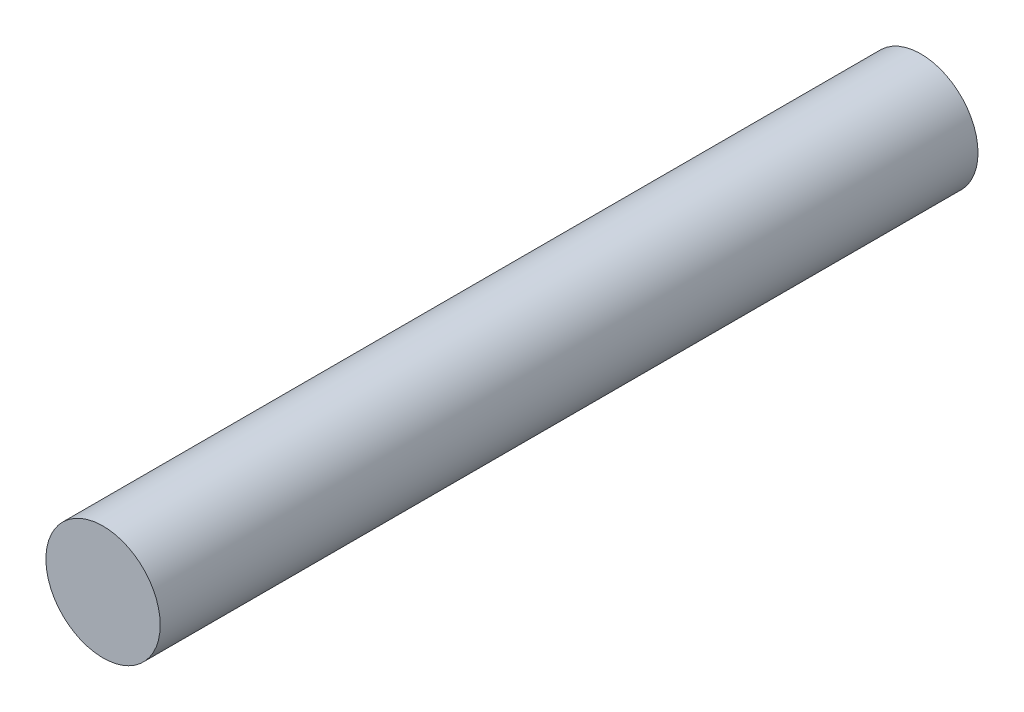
from build123d import *

# Parameters (mm, degrees)
SKETCH2_R           = 5
BOSS_EXTRUDE2_DEPTH = 71.547005


with BuildPart() as part:
    # Sketch2 → Boss-Extrude2 (new body)
    with BuildSketch(Plane.XY):
        Circle(SKETCH2_R)
    extrude(amount=-BOSS_EXTRUDE2_DEPTH)


solid = part.part
